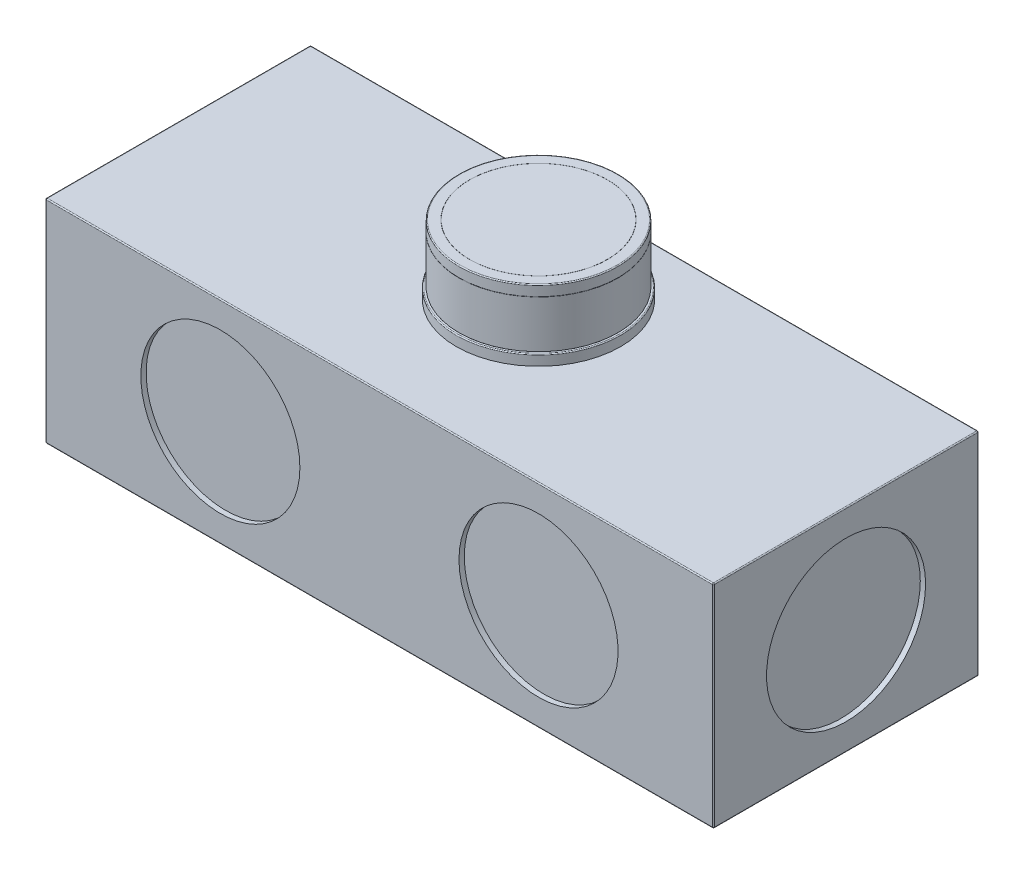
from build123d import *

# Parameters (mm, degrees)
SKETCH1_W           = 63
SKETCH1_H           = 20
BOSS_EXTRUDE1_DEPTH = 25
SKETCH2_R           = 7.5
CUT_EXTRUDE1_DEPTH  = 0.5
CUT_EXTRUDE2_START  = -0.5
SKETCH3_R           = 7.5
CUT_EXTRUDE2_DEPTH  = 0.5
BOSS_EXTRUDE3_DEPTH = 6.5
FILLET2_R           = 0.1
SKETCH8_R           = 7.5
CUT_EXTRUDE3_DEPTH  = 0.5


with BuildPart() as part:
    # Sketch1 → Boss-Extrude1 (new body)
    with BuildSketch(Plane.XY):
        with Locations((0, 10)):
            Rectangle(SKETCH1_W, SKETCH1_H)
    extrude(amount=BOSS_EXTRUDE1_DEPTH)

    # Sketch2 → Cut-Extrude1 (cut)
    with BuildSketch(Plane(origin=(31.5, 0, 0), x_dir=(0, 0, -1), z_dir=(1, 0, 0))):
        with Locations((-12.5, 10)):
            Circle(SKETCH2_R)
    extrude(amount=-CUT_EXTRUDE1_DEPTH, mode=Mode.SUBTRACT)

    # Sketch3 → Cut-Extrude2 (cut)
    with BuildSketch(Plane.ZY.offset(31.5).offset(CUT_EXTRUDE2_START)):
        with Locations(Location((12.5, 10, 0), (0, 0, 180))):
            Circle(SKETCH3_R)
    extrude(amount=CUT_EXTRUDE2_DEPTH, mode=Mode.SUBTRACT)

    # Sketch4 → Revolve2 (revolve)
    with BuildSketch(Plane(origin=(0, 0, 0), x_dir=(0, 0, -1), z_dir=(1, 0, 0))):
        with BuildLine():
            Line((-17.5, 21.019), (-17.5, 25.481))
            ThreePointArc((-17.5, 25.481), (-17.497363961, 25.487363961), (-17.491, 25.49))
            Line((-17.491, 25.49), (-17.49, 25.49))
            Line((-17.49, 25.49), (-17.49, 25.5))
            ThreePointArc((-17.49, 25.5), (-17.497363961, 25.502636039), (-17.5, 25.509))
            Line((-17.5, 25.509), (-17.5, 26.41))
            ThreePointArc((-17.5, 26.41), (-17.47363961, 26.47363961), (-17.41, 26.5))
            Line((-17.41, 26.5), (-16.51, 26.5))
            Line((-16.51, 26.5), (-16.51, 26.4))
            Line((-16.51, 26.4), (-16.5, 26.4))
            Line((-16.5, 26.4), (-16.5, 26.5))
            Line((-16.5, 26.5), (-10, 26.5))
            Line((-10, 26.5), (-10, -0.9))
            Line((-10, -0.9), (-10, -1))
            Line((-10, -1), (-14.75, -1))
            Line((-14.75, -1), (-14.75, -0.9))
            Line((-14.75, -0.9), (-17.66, -0.9))
            ThreePointArc((-17.66, -0.9), (-17.72363961, -0.87363961), (-17.75, -0.81))
            Line((-17.75, -0.81), (-17.75, 20.91))
            ThreePointArc((-17.75, 20.91), (-17.72363961, 20.97363961), (-17.66, 21))
            Line((-17.66, 21), (-17.4, 21))
            Line((-17.4, 21), (-17.4, 21.01))
            Line((-17.4, 21.01), (-17.491, 21.01))
            ThreePointArc((-17.491, 21.01), (-17.497363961, 21.012636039), (-17.5, 21.019))
        make_face()
    revolve(axis=Axis((0, 26.5, 10), (0, -1, 0)))

    # Sketch6 → Boss-Extrude3 (add)
    with BuildSketch(Plane.XZ.offset(1)):
        Polygon((0, 17.794228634), (-6.75, 13.897114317), (-6.75, 6.102885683), (0, 2.205771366), (6.75, 6.102885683), (6.75, 13.897114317), align=None)
    extrude(amount=BOSS_EXTRUDE3_DEPTH)

    # Sketch7 → Cut-Revolve1 (revolve, cut)
    with BuildSketch(Plane(origin=(0, 0, 0), x_dir=(0, 0, -1), z_dir=(1, 0, 0))):
        Polygon((-18.024228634, -6.72), (-16.638350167, -7.62), (-18.024228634, -7.62), align=None)
        Polygon((-18.024228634, -1.78), (-18.024228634, -0.924068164), (-16.707787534, -0.924068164), align=None)
    revolve(axis=Axis((0, -1, 10), (0, -1, 0)), mode=Mode.SUBTRACT)

    # Fillet2
    fillet2_edges = [part.edges().sort_by_distance(p)[0] for p in [
        (31.5, 10, 25),
        (0, 20, 25),
        (-31.5, 10, 25),
        (0, 20, 0),
        (31.5, 10, 0),
        (0, 0, 0),
        (-31.5, 10, 0),
        (0, 0, 25),
        (-31.5, 20, 12.5),
        (31.5, 20, 12.5),
        (31.5, 0, 12.5),
        (-31.5, 0, 12.5),
    ]]
    fillet(fillet2_edges, radius=FILLET2_R)

    # Sketch8 → Cut-Extrude3 (cut)
    with BuildSketch(Plane.XY.offset(25)):
        with Locations((-15, 10)):
            Circle(SKETCH8_R)
        with Locations(Location((15, 10, 0), (0, 0, 180))):
            Circle(SKETCH8_R)
    extrude(amount=-CUT_EXTRUDE3_DEPTH, mode=Mode.SUBTRACT)


solid = part.part
